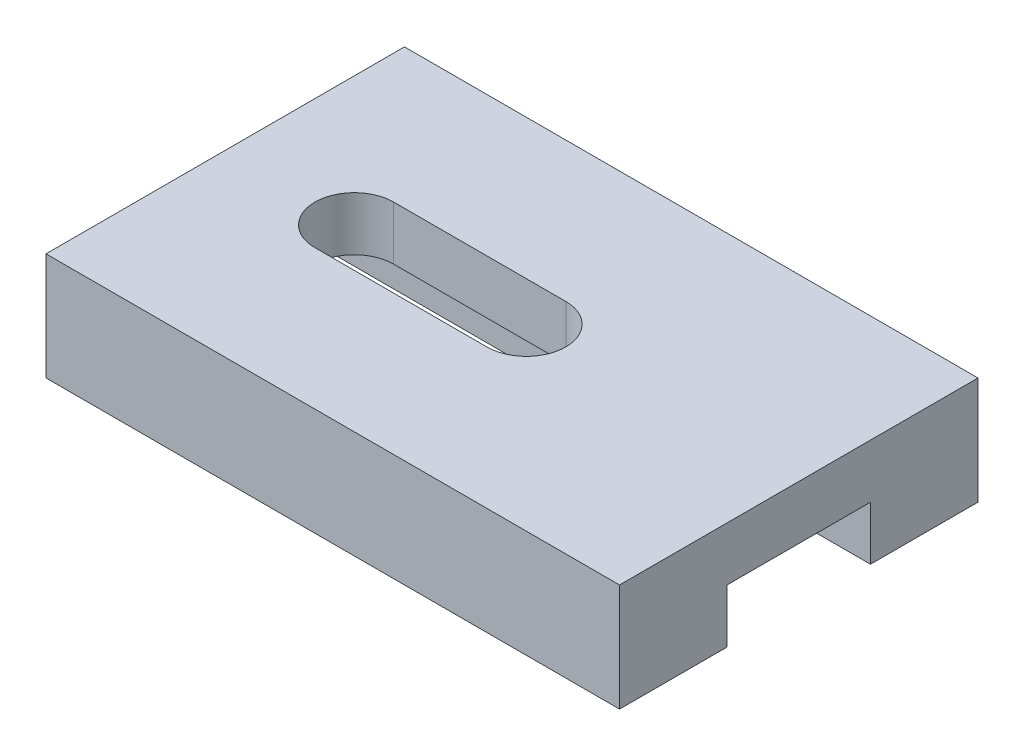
ISO-10303-21;
HEADER;
FILE_DESCRIPTION(('STEP AP214'),'2;1');
FILE_NAME('part.step','',(''),(''),'','','');
FILE_SCHEMA(('AUTOMOTIVE_DESIGN { 1 0 10303 214 1 1 1 1 }'));
ENDSEC;
DATA;
#1=APPLICATION_CONTEXT('core data for automotive mechanical design processes');
#2=APPLICATION_PROTOCOL_DEFINITION('international standard','automotive_design',2000,#1);
#3=PRODUCT_CONTEXT('',#1,'mechanical');
#4=PRODUCT('Part','Part','',(#3));
#5=PRODUCT_RELATED_PRODUCT_CATEGORY('part','',(#4));
#6=PRODUCT_DEFINITION_FORMATION('','',#4);
#7=PRODUCT_DEFINITION_CONTEXT('part definition',#1,'design');
#8=PRODUCT_DEFINITION('design','',#6,#7);
#9=PRODUCT_DEFINITION_SHAPE('','',#8);
#10=(LENGTH_UNIT() NAMED_UNIT(*) SI_UNIT(.MILLI.,.METRE.));
#11=(NAMED_UNIT(*) PLANE_ANGLE_UNIT() SI_UNIT($,.RADIAN.));
#12=(NAMED_UNIT(*) SI_UNIT($,.STERADIAN.) SOLID_ANGLE_UNIT());
#13=UNCERTAINTY_MEASURE_WITH_UNIT(LENGTH_MEASURE(1.E-05),#10,'distance_accuracy_value','');
#14=(GEOMETRIC_REPRESENTATION_CONTEXT(3) GLOBAL_UNCERTAINTY_ASSIGNED_CONTEXT((#13)) GLOBAL_UNIT_ASSIGNED_CONTEXT((#10,
#11,#12)) REPRESENTATION_CONTEXT('',''));
#15=CARTESIAN_POINT('',(0.,0.,0.));
#16=DIRECTION('',(0.,0.,1.));
#17=DIRECTION('',(1.,0.,0.));
#18=AXIS2_PLACEMENT_3D('',#15,#16,#17);
#19=CARTESIAN_POINT('',(-60.,0.,50.));
#20=DIRECTION('',(0.,1.,0.));
#21=DIRECTION('',(0.,0.,1.));
#22=AXIS2_PLACEMENT_3D('',#19,#20,#21);
#23=PLANE('',#22);
#24=DIRECTION('',(0.,0.,-1.));
#25=VECTOR('',#24,1.);
#26=CARTESIAN_POINT('',(100.,0.,-50.));
#27=LINE('',#26,#25);
#28=CARTESIAN_POINT('',(100.,0.,-20.));
#29=VERTEX_POINT('',#28);
#30=CARTESIAN_POINT('',(100.,0.,-50.));
#31=VERTEX_POINT('',#30);
#32=EDGE_CURVE('E191',#29,#31,#27,.T.);
#33=ORIENTED_EDGE('',*,*,#32,.F.);
#34=DIRECTION('',(-1.,0.,0.));
#35=VECTOR('',#34,1.);
#36=CARTESIAN_POINT('',(100.,0.,-20.));
#37=LINE('',#36,#35);
#38=CARTESIAN_POINT('',(-60.,0.,-20.));
#39=VERTEX_POINT('',#38);
#40=EDGE_CURVE('E166',#29,#39,#37,.T.);
#41=ORIENTED_EDGE('',*,*,#40,.T.);
#42=DIRECTION('',(0.,0.,1.));
#43=VECTOR('',#42,1.);
#44=CARTESIAN_POINT('',(-60.,0.,-50.));
#45=LINE('',#44,#43);
#46=CARTESIAN_POINT('',(-60.,0.,-50.));
#47=VERTEX_POINT('',#46);
#48=EDGE_CURVE('E186',#47,#39,#45,.T.);
#49=ORIENTED_EDGE('',*,*,#48,.F.);
#50=DIRECTION('',(-1.,0.,0.));
#51=VECTOR('',#50,1.);
#52=CARTESIAN_POINT('',(-60.,0.,-50.));
#53=LINE('',#52,#51);
#54=EDGE_CURVE('E179',#31,#47,#53,.T.);
#55=ORIENTED_EDGE('',*,*,#54,.F.);
#56=EDGE_LOOP('',(#33,#41,#49,#55));
#57=FACE_BOUND('',#56,.T.);
#58=ADVANCED_FACE('F31',(#57),#23,.F.);
#59=CARTESIAN_POINT('',(-60.,30.,-50.));
#60=DIRECTION('',(1.,0.,0.));
#61=DIRECTION('',(0.,0.,-1.));
#62=AXIS2_PLACEMENT_3D('',#59,#60,#61);
#63=PLANE('',#62);
#64=ORIENTED_EDGE('',*,*,#48,.T.);
#65=DIRECTION('',(0.,-1.,0.));
#66=VECTOR('',#65,1.);
#67=CARTESIAN_POINT('',(-60.,0.,-20.));
#68=LINE('',#67,#66);
#69=CARTESIAN_POINT('',(-60.,15.,-20.));
#70=VERTEX_POINT('',#69);
#71=EDGE_CURVE('E153',#70,#39,#68,.T.);
#72=ORIENTED_EDGE('',*,*,#71,.F.);
#73=DIRECTION('',(0.,0.,-1.));
#74=VECTOR('',#73,1.);
#75=CARTESIAN_POINT('',(-60.,15.,-20.));
#76=LINE('',#75,#74);
#77=CARTESIAN_POINT('',(-60.,15.,20.));
#78=VERTEX_POINT('',#77);
#79=EDGE_CURVE('E162',#78,#70,#76,.T.);
#80=ORIENTED_EDGE('',*,*,#79,.F.);
#81=DIRECTION('',(0.,1.,0.));
#82=VECTOR('',#81,1.);
#83=CARTESIAN_POINT('',(-60.,15.,20.));
#84=LINE('',#83,#82);
#85=CARTESIAN_POINT('',(-60.,0.,20.));
#86=VERTEX_POINT('',#85);
#87=EDGE_CURVE('E146',#86,#78,#84,.T.);
#88=ORIENTED_EDGE('',*,*,#87,.F.);
#89=CARTESIAN_POINT('',(-60.,0.,50.));
#90=VERTEX_POINT('',#89);
#91=EDGE_CURVE('E169',#86,#90,#45,.T.);
#92=ORIENTED_EDGE('',*,*,#91,.T.);
#93=DIRECTION('',(0.,-1.,0.));
#94=VECTOR('',#93,1.);
#95=CARTESIAN_POINT('',(-60.,30.,50.));
#96=LINE('',#95,#94);
#97=CARTESIAN_POINT('',(-60.,30.,50.));
#98=VERTEX_POINT('',#97);
#99=EDGE_CURVE('E204',#98,#90,#96,.T.);
#100=ORIENTED_EDGE('',*,*,#99,.F.);
#101=DIRECTION('',(0.,0.,1.));
#102=VECTOR('',#101,1.);
#103=CARTESIAN_POINT('',(-60.,30.,-50.));
#104=LINE('',#103,#102);
#105=CARTESIAN_POINT('',(-60.,30.,-50.));
#106=VERTEX_POINT('',#105);
#107=EDGE_CURVE('E175',#106,#98,#104,.T.);
#108=ORIENTED_EDGE('',*,*,#107,.F.);
#109=DIRECTION('',(0.,-1.,0.));
#110=VECTOR('',#109,1.);
#111=CARTESIAN_POINT('',(-60.,30.,-50.));
#112=LINE('',#111,#110);
#113=EDGE_CURVE('E185',#106,#47,#112,.T.);
#114=ORIENTED_EDGE('',*,*,#113,.T.);
#115=EDGE_LOOP('',(#64,#72,#80,#88,#92,#100,#108,#114));
#116=FACE_BOUND('',#115,.T.);
#117=ADVANCED_FACE('F33',(#116),#63,.F.);
#118=CARTESIAN_POINT('',(-60.,30.,50.));
#119=DIRECTION('',(0.,0.,-1.));
#120=DIRECTION('',(-1.,0.,0.));
#121=AXIS2_PLACEMENT_3D('',#118,#119,#120);
#122=PLANE('',#121);
#123=DIRECTION('',(1.,0.,0.));
#124=VECTOR('',#123,1.);
#125=CARTESIAN_POINT('',(-60.,0.,50.));
#126=LINE('',#125,#124);
#127=CARTESIAN_POINT('',(100.,0.,50.));
#128=VERTEX_POINT('',#127);
#129=EDGE_CURVE('E189',#90,#128,#126,.T.);
#130=ORIENTED_EDGE('',*,*,#129,.T.);
#131=DIRECTION('',(0.,-1.,0.));
#132=VECTOR('',#131,1.);
#133=CARTESIAN_POINT('',(100.,30.,50.));
#134=LINE('',#133,#132);
#135=CARTESIAN_POINT('',(100.,30.,50.));
#136=VERTEX_POINT('',#135);
#137=EDGE_CURVE('E201',#136,#128,#134,.T.);
#138=ORIENTED_EDGE('',*,*,#137,.F.);
#139=DIRECTION('',(1.,0.,0.));
#140=VECTOR('',#139,1.);
#141=CARTESIAN_POINT('',(-60.,30.,50.));
#142=LINE('',#141,#140);
#143=EDGE_CURVE('E178',#98,#136,#142,.T.);
#144=ORIENTED_EDGE('',*,*,#143,.F.);
#145=ORIENTED_EDGE('',*,*,#99,.T.);
#146=EDGE_LOOP('',(#130,#138,#144,#145));
#147=FACE_BOUND('',#146,.T.);
#148=ADVANCED_FACE('F236',(#147),#122,.F.);
#149=CARTESIAN_POINT('',(100.,30.,-50.));
#150=DIRECTION('',(-1.,0.,0.));
#151=DIRECTION('',(0.,0.,1.));
#152=AXIS2_PLACEMENT_3D('',#149,#150,#151);
#153=PLANE('',#152);
#154=DIRECTION('',(0.,0.,-1.));
#155=VECTOR('',#154,1.);
#156=CARTESIAN_POINT('',(100.,15.,-20.));
#157=LINE('',#156,#155);
#158=CARTESIAN_POINT('',(100.,15.,20.));
#159=VERTEX_POINT('',#158);
#160=CARTESIAN_POINT('',(100.,15.,-20.));
#161=VERTEX_POINT('',#160);
#162=EDGE_CURVE('E152',#159,#161,#157,.T.);
#163=ORIENTED_EDGE('',*,*,#162,.T.);
#164=DIRECTION('',(0.,-1.,0.));
#165=VECTOR('',#164,1.);
#166=CARTESIAN_POINT('',(100.,0.,-20.));
#167=LINE('',#166,#165);
#168=EDGE_CURVE('E156',#161,#29,#167,.T.);
#169=ORIENTED_EDGE('',*,*,#168,.T.);
#170=ORIENTED_EDGE('',*,*,#32,.T.);
#171=DIRECTION('',(0.,-1.,0.));
#172=VECTOR('',#171,1.);
#173=CARTESIAN_POINT('',(100.,30.,-50.));
#174=LINE('',#173,#172);
#175=CARTESIAN_POINT('',(100.,30.,-50.));
#176=VERTEX_POINT('',#175);
#177=EDGE_CURVE('E198',#176,#31,#174,.T.);
#178=ORIENTED_EDGE('',*,*,#177,.F.);
#179=DIRECTION('',(0.,0.,-1.));
#180=VECTOR('',#179,1.);
#181=CARTESIAN_POINT('',(100.,30.,-50.));
#182=LINE('',#181,#180);
#183=EDGE_CURVE('E181',#136,#176,#182,.T.);
#184=ORIENTED_EDGE('',*,*,#183,.F.);
#185=ORIENTED_EDGE('',*,*,#137,.T.);
#186=CARTESIAN_POINT('',(100.,0.,20.));
#187=VERTEX_POINT('',#186);
#188=EDGE_CURVE('E192',#128,#187,#27,.T.);
#189=ORIENTED_EDGE('',*,*,#188,.T.);
#190=DIRECTION('',(0.,1.,0.));
#191=VECTOR('',#190,1.);
#192=CARTESIAN_POINT('',(100.,15.,20.));
#193=LINE('',#192,#191);
#194=EDGE_CURVE('E149',#187,#159,#193,.T.);
#195=ORIENTED_EDGE('',*,*,#194,.T.);
#196=EDGE_LOOP('',(#163,#169,#170,#178,#184,#185,#189,#195));
#197=FACE_BOUND('',#196,.T.);
#198=ADVANCED_FACE('F261',(#197),#153,.F.);
#199=CARTESIAN_POINT('',(-60.,30.,-50.));
#200=DIRECTION('',(0.,0.,1.));
#201=DIRECTION('',(1.,0.,0.));
#202=AXIS2_PLACEMENT_3D('',#199,#200,#201);
#203=PLANE('',#202);
#204=ORIENTED_EDGE('',*,*,#54,.T.);
#205=ORIENTED_EDGE('',*,*,#113,.F.);
#206=DIRECTION('',(-1.,0.,0.));
#207=VECTOR('',#206,1.);
#208=CARTESIAN_POINT('',(-60.,30.,-50.));
#209=LINE('',#208,#207);
#210=EDGE_CURVE('E183',#176,#106,#209,.T.);
#211=ORIENTED_EDGE('',*,*,#210,.F.);
#212=ORIENTED_EDGE('',*,*,#177,.T.);
#213=EDGE_LOOP('',(#204,#205,#211,#212));
#214=FACE_BOUND('',#213,.T.);
#215=ADVANCED_FACE('F249',(#214),#203,.F.);
#216=CARTESIAN_POINT('',(-60.,30.,50.));
#217=DIRECTION('',(0.,1.,0.));
#218=DIRECTION('',(0.,0.,1.));
#219=AXIS2_PLACEMENT_3D('',#216,#217,#218);
#220=PLANE('',#219);
#221=CARTESIAN_POINT('',(24.,30.,0.));
#222=DIRECTION('',(0.,1.,0.));
#223=DIRECTION('',(0.,0.,1.));
#224=AXIS2_PLACEMENT_3D('',#221,#222,#223);
#225=CIRCLE('',#224,11.);
#226=CARTESIAN_POINT('',(24.,30.,11.));
#227=VERTEX_POINT('',#226);
#228=CARTESIAN_POINT('',(24.,30.,-11.));
#229=VERTEX_POINT('',#228);
#230=EDGE_CURVE('E46',#227,#229,#225,.T.);
#231=ORIENTED_EDGE('',*,*,#230,.F.);
#232=DIRECTION('',(1.,0.,0.));
#233=VECTOR('',#232,1.);
#234=CARTESIAN_POINT('',(24.,30.,11.));
#235=LINE('',#234,#233);
#236=CARTESIAN_POINT('',(-24.,30.,11.));
#237=VERTEX_POINT('',#236);
#238=EDGE_CURVE('E139',#237,#227,#235,.T.);
#239=ORIENTED_EDGE('',*,*,#238,.F.);
#240=CARTESIAN_POINT('',(-24.,30.,0.));
#241=DIRECTION('',(0.,1.,0.));
#242=DIRECTION('',(0.,0.,-1.));
#243=AXIS2_PLACEMENT_3D('',#240,#241,#242);
#244=CIRCLE('',#243,11.);
#245=CARTESIAN_POINT('',(-24.,30.,-11.));
#246=VERTEX_POINT('',#245);
#247=EDGE_CURVE('E123',#246,#237,#244,.T.);
#248=ORIENTED_EDGE('',*,*,#247,.F.);
#249=DIRECTION('',(-1.,0.,0.));
#250=VECTOR('',#249,1.);
#251=CARTESIAN_POINT('',(24.,30.,-11.));
#252=LINE('',#251,#250);
#253=EDGE_CURVE('E132',#229,#246,#252,.T.);
#254=ORIENTED_EDGE('',*,*,#253,.F.);
#255=EDGE_LOOP('',(#231,#239,#248,#254));
#256=FACE_BOUND('',#255,.T.);
#257=ORIENTED_EDGE('',*,*,#107,.T.);
#258=ORIENTED_EDGE('',*,*,#143,.T.);
#259=ORIENTED_EDGE('',*,*,#183,.T.);
#260=ORIENTED_EDGE('',*,*,#210,.T.);
#261=EDGE_LOOP('',(#257,#258,#259,#260));
#262=FACE_BOUND('',#261,.T.);
#263=ADVANCED_FACE('F136',(#256,#262),#220,.T.);
#264=ORIENTED_EDGE('',*,*,#91,.F.);
#265=DIRECTION('',(-1.,0.,0.));
#266=VECTOR('',#265,1.);
#267=CARTESIAN_POINT('',(100.,0.,20.));
#268=LINE('',#267,#266);
#269=EDGE_CURVE('E159',#187,#86,#268,.T.);
#270=ORIENTED_EDGE('',*,*,#269,.F.);
#271=ORIENTED_EDGE('',*,*,#188,.F.);
#272=ORIENTED_EDGE('',*,*,#129,.F.);
#273=EDGE_LOOP('',(#264,#270,#271,#272));
#274=FACE_BOUND('',#273,.T.);
#275=ADVANCED_FACE('F232',(#274),#23,.F.);
#276=CARTESIAN_POINT('',(100.,0.,-20.));
#277=DIRECTION('',(0.,0.,-1.));
#278=DIRECTION('',(0.,1.,0.));
#279=AXIS2_PLACEMENT_3D('',#276,#277,#278);
#280=PLANE('',#279);
#281=ORIENTED_EDGE('',*,*,#71,.T.);
#282=ORIENTED_EDGE('',*,*,#40,.F.);
#283=ORIENTED_EDGE('',*,*,#168,.F.);
#284=DIRECTION('',(-1.,0.,0.));
#285=VECTOR('',#284,1.);
#286=CARTESIAN_POINT('',(100.,15.,-20.));
#287=LINE('',#286,#285);
#288=EDGE_CURVE('E170',#161,#70,#287,.T.);
#289=ORIENTED_EDGE('',*,*,#288,.T.);
#290=EDGE_LOOP('',(#281,#282,#283,#289));
#291=FACE_BOUND('',#290,.T.);
#292=ADVANCED_FACE('F242',(#291),#280,.F.);
#293=CARTESIAN_POINT('',(100.,15.,-20.));
#294=DIRECTION('',(0.,1.,0.));
#295=DIRECTION('',(0.,0.,1.));
#296=AXIS2_PLACEMENT_3D('',#293,#294,#295);
#297=PLANE('',#296);
#298=DIRECTION('',(1.,0.,0.));
#299=VECTOR('',#298,1.);
#300=CARTESIAN_POINT('',(100.,15.,11.));
#301=LINE('',#300,#299);
#302=CARTESIAN_POINT('',(-24.,15.,11.));
#303=VERTEX_POINT('',#302);
#304=CARTESIAN_POINT('',(24.,15.,11.));
#305=VERTEX_POINT('',#304);
#306=EDGE_CURVE('E39',#303,#305,#301,.T.);
#307=ORIENTED_EDGE('',*,*,#306,.T.);
#308=CARTESIAN_POINT('',(24.,15.,0.));
#309=DIRECTION('',(0.,1.,0.));
#310=DIRECTION('',(0.,0.,1.));
#311=AXIS2_PLACEMENT_3D('',#308,#309,#310);
#312=CIRCLE('',#311,11.);
#313=CARTESIAN_POINT('',(24.,15.,-11.));
#314=VERTEX_POINT('',#313);
#315=EDGE_CURVE('E11',#305,#314,#312,.T.);
#316=ORIENTED_EDGE('',*,*,#315,.T.);
#317=DIRECTION('',(-1.,0.,0.));
#318=VECTOR('',#317,1.);
#319=CARTESIAN_POINT('',(100.,15.,-11.));
#320=LINE('',#319,#318);
#321=CARTESIAN_POINT('',(-24.,15.,-11.));
#322=VERTEX_POINT('',#321);
#323=EDGE_CURVE('E207',#314,#322,#320,.T.);
#324=ORIENTED_EDGE('',*,*,#323,.T.);
#325=CARTESIAN_POINT('',(-24.,15.,0.));
#326=DIRECTION('',(0.,1.,0.));
#327=DIRECTION('',(0.,0.,1.));
#328=AXIS2_PLACEMENT_3D('',#325,#326,#327);
#329=CIRCLE('',#328,11.);
#330=EDGE_CURVE('E126',#322,#303,#329,.T.);
#331=ORIENTED_EDGE('',*,*,#330,.T.);
#332=EDGE_LOOP('',(#307,#316,#324,#331));
#333=FACE_BOUND('',#332,.T.);
#334=ORIENTED_EDGE('',*,*,#79,.T.);
#335=ORIENTED_EDGE('',*,*,#288,.F.);
#336=ORIENTED_EDGE('',*,*,#162,.F.);
#337=DIRECTION('',(-1.,0.,0.));
#338=VECTOR('',#337,1.);
#339=CARTESIAN_POINT('',(100.,15.,20.));
#340=LINE('',#339,#338);
#341=EDGE_CURVE('E172',#159,#78,#340,.T.);
#342=ORIENTED_EDGE('',*,*,#341,.T.);
#343=EDGE_LOOP('',(#334,#335,#336,#342));
#344=FACE_BOUND('',#343,.T.);
#345=ADVANCED_FACE('F211',(#333,#344),#297,.F.);
#346=CARTESIAN_POINT('',(100.,15.,20.));
#347=DIRECTION('',(0.,0.,1.));
#348=DIRECTION('',(0.,-1.,0.));
#349=AXIS2_PLACEMENT_3D('',#346,#347,#348);
#350=PLANE('',#349);
#351=ORIENTED_EDGE('',*,*,#87,.T.);
#352=ORIENTED_EDGE('',*,*,#341,.F.);
#353=ORIENTED_EDGE('',*,*,#194,.F.);
#354=ORIENTED_EDGE('',*,*,#269,.T.);
#355=EDGE_LOOP('',(#351,#352,#353,#354));
#356=FACE_BOUND('',#355,.T.);
#357=ADVANCED_FACE('F218',(#356),#350,.F.);
#358=CARTESIAN_POINT('',(24.,0.,0.));
#359=DIRECTION('',(0.,1.,0.));
#360=DIRECTION('',(0.,0.,1.));
#361=AXIS2_PLACEMENT_3D('',#358,#359,#360);
#362=CYLINDRICAL_SURFACE('',#361,11.);
#363=DIRECTION('',(0.,1.,0.));
#364=VECTOR('',#363,1.);
#365=CARTESIAN_POINT('',(24.,0.,11.));
#366=LINE('',#365,#364);
#367=EDGE_CURVE('E144',#305,#227,#366,.T.);
#368=ORIENTED_EDGE('',*,*,#367,.T.);
#369=ORIENTED_EDGE('',*,*,#230,.T.);
#370=DIRECTION('',(0.,1.,0.));
#371=VECTOR('',#370,1.);
#372=CARTESIAN_POINT('',(24.,0.,-11.));
#373=LINE('',#372,#371);
#374=EDGE_CURVE('E129',#314,#229,#373,.T.);
#375=ORIENTED_EDGE('',*,*,#374,.F.);
#376=ORIENTED_EDGE('',*,*,#315,.F.);
#377=EDGE_LOOP('',(#368,#369,#375,#376));
#378=FACE_BOUND('',#377,.T.);
#379=ADVANCED_FACE('F216',(#378),#362,.F.);
#380=CARTESIAN_POINT('',(24.,0.,11.));
#381=DIRECTION('',(0.,0.,1.));
#382=DIRECTION('',(1.,0.,0.));
#383=AXIS2_PLACEMENT_3D('',#380,#381,#382);
#384=PLANE('',#383);
#385=DIRECTION('',(0.,1.,0.));
#386=VECTOR('',#385,1.);
#387=CARTESIAN_POINT('',(-24.,0.,11.));
#388=LINE('',#387,#386);
#389=EDGE_CURVE('E128',#303,#237,#388,.T.);
#390=ORIENTED_EDGE('',*,*,#389,.T.);
#391=ORIENTED_EDGE('',*,*,#238,.T.);
#392=ORIENTED_EDGE('',*,*,#367,.F.);
#393=ORIENTED_EDGE('',*,*,#306,.F.);
#394=EDGE_LOOP('',(#390,#391,#392,#393));
#395=FACE_BOUND('',#394,.T.);
#396=ADVANCED_FACE('F215',(#395),#384,.F.);
#397=CARTESIAN_POINT('',(-24.,0.,0.));
#398=DIRECTION('',(0.,1.,0.));
#399=DIRECTION('',(0.,0.,1.));
#400=AXIS2_PLACEMENT_3D('',#397,#398,#399);
#401=CYLINDRICAL_SURFACE('',#400,11.);
#402=DIRECTION('',(0.,1.,0.));
#403=VECTOR('',#402,1.);
#404=CARTESIAN_POINT('',(-24.,0.,-11.));
#405=LINE('',#404,#403);
#406=EDGE_CURVE('E54',#322,#246,#405,.T.);
#407=ORIENTED_EDGE('',*,*,#406,.T.);
#408=ORIENTED_EDGE('',*,*,#247,.T.);
#409=ORIENTED_EDGE('',*,*,#389,.F.);
#410=ORIENTED_EDGE('',*,*,#330,.F.);
#411=EDGE_LOOP('',(#407,#408,#409,#410));
#412=FACE_BOUND('',#411,.T.);
#413=ADVANCED_FACE('F120',(#412),#401,.F.);
#414=CARTESIAN_POINT('',(24.,0.,-11.));
#415=DIRECTION('',(0.,0.,-1.));
#416=DIRECTION('',(-1.,0.,0.));
#417=AXIS2_PLACEMENT_3D('',#414,#415,#416);
#418=PLANE('',#417);
#419=ORIENTED_EDGE('',*,*,#374,.T.);
#420=ORIENTED_EDGE('',*,*,#253,.T.);
#421=ORIENTED_EDGE('',*,*,#406,.F.);
#422=ORIENTED_EDGE('',*,*,#323,.F.);
#423=EDGE_LOOP('',(#419,#420,#421,#422));
#424=FACE_BOUND('',#423,.T.);
#425=ADVANCED_FACE('F133',(#424),#418,.F.);
#426=CLOSED_SHELL('',(#58,#117,#148,#198,#215,#263,#275,#292,#345,#357,#379,#396,#413,#425));
#427=MANIFOLD_SOLID_BREP('B2',#426);
#428=ADVANCED_BREP_SHAPE_REPRESENTATION('',(#18,#427),#14);
#429=SHAPE_DEFINITION_REPRESENTATION(#9,#428);
ENDSEC;
END-ISO-10303-21;
